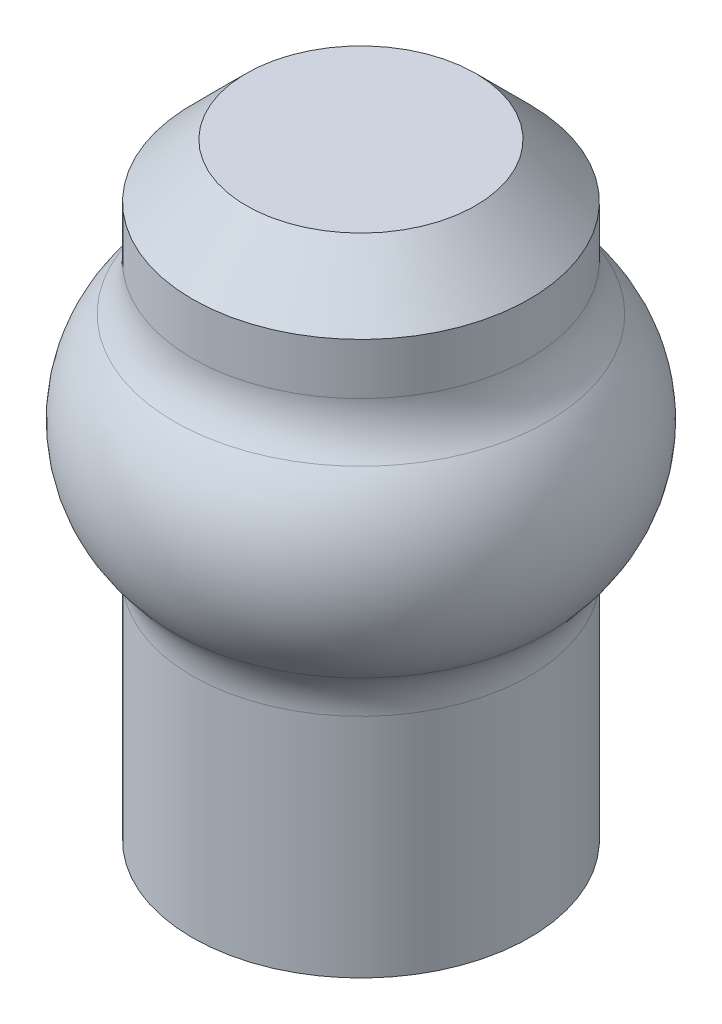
ISO-10303-21;
HEADER;
FILE_DESCRIPTION(('STEP AP214'),'2;1');
FILE_NAME('part.step','',(''),(''),'','','');
FILE_SCHEMA(('AUTOMOTIVE_DESIGN { 1 0 10303 214 1 1 1 1 }'));
ENDSEC;
DATA;
#1=APPLICATION_CONTEXT('core data for automotive mechanical design processes');
#2=APPLICATION_PROTOCOL_DEFINITION('international standard','automotive_design',2000,#1);
#3=PRODUCT_CONTEXT('',#1,'mechanical');
#4=PRODUCT('Part','Part','',(#3));
#5=PRODUCT_RELATED_PRODUCT_CATEGORY('part','',(#4));
#6=PRODUCT_DEFINITION_FORMATION('','',#4);
#7=PRODUCT_DEFINITION_CONTEXT('part definition',#1,'design');
#8=PRODUCT_DEFINITION('design','',#6,#7);
#9=PRODUCT_DEFINITION_SHAPE('','',#8);
#10=(LENGTH_UNIT() NAMED_UNIT(*) SI_UNIT(.MILLI.,.METRE.));
#11=(NAMED_UNIT(*) PLANE_ANGLE_UNIT() SI_UNIT($,.RADIAN.));
#12=(NAMED_UNIT(*) SI_UNIT($,.STERADIAN.) SOLID_ANGLE_UNIT());
#13=UNCERTAINTY_MEASURE_WITH_UNIT(LENGTH_MEASURE(1.E-05),#10,'distance_accuracy_value','');
#14=(GEOMETRIC_REPRESENTATION_CONTEXT(3) GLOBAL_UNCERTAINTY_ASSIGNED_CONTEXT((#13)) GLOBAL_UNIT_ASSIGNED_CONTEXT((#10,
#11,#12)) REPRESENTATION_CONTEXT('',''));
#15=CARTESIAN_POINT('',(0.,0.,0.));
#16=DIRECTION('',(0.,0.,1.));
#17=DIRECTION('',(1.,0.,0.));
#18=AXIS2_PLACEMENT_3D('',#15,#16,#17);
#19=CARTESIAN_POINT('',(0.,0.,0.));
#20=DIRECTION('',(0.,1.,0.));
#21=DIRECTION('',(0.,0.,1.));
#22=AXIS2_PLACEMENT_3D('',#19,#20,#21);
#23=PLANE('',#22);
#24=CARTESIAN_POINT('',(0.,0.,0.));
#25=DIRECTION('',(0.,-1.,0.));
#26=DIRECTION('',(0.,0.,-1.));
#27=AXIS2_PLACEMENT_3D('',#24,#25,#26);
#28=CIRCLE('',#27,12.5);
#29=CARTESIAN_POINT('',(0.,0.,-12.5));
#30=VERTEX_POINT('',#29);
#31=EDGE_CURVE('E40',#30,#30,#28,.T.);
#32=ORIENTED_EDGE('',*,*,#31,.T.);
#33=EDGE_LOOP('',(#32));
#34=FACE_BOUND('',#33,.T.);
#35=ADVANCED_FACE('F30',(#34),#23,.F.);
#36=CARTESIAN_POINT('',(0.,0.,0.));
#37=DIRECTION('',(0.,-1.,0.));
#38=DIRECTION('',(0.,0.,-1.));
#39=AXIS2_PLACEMENT_3D('',#36,#37,#38);
#40=CYLINDRICAL_SURFACE('',#39,12.5);
#41=ORIENTED_EDGE('',*,*,#31,.F.);
#42=EDGE_LOOP('',(#41));
#43=FACE_BOUND('',#42,.T.);
#44=CARTESIAN_POINT('',(0.,16.8019609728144,0.));
#45=DIRECTION('',(0.,-1.,0.));
#46=DIRECTION('',(0.,0.,-1.));
#47=AXIS2_PLACEMENT_3D('',#44,#45,#46);
#48=CIRCLE('',#47,12.5);
#49=CARTESIAN_POINT('',(0.,16.8019609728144,-12.5));
#50=VERTEX_POINT('',#49);
#51=EDGE_CURVE('E44',#50,#50,#48,.T.);
#52=ORIENTED_EDGE('',*,*,#51,.T.);
#53=EDGE_LOOP('',(#52));
#54=FACE_BOUND('',#53,.T.);
#55=ADVANCED_FACE('F76',(#43,#54),#40,.T.);
#56=CARTESIAN_POINT('',(0.,16.8019609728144,0.));
#57=DIRECTION('',(0.,-1.,0.));
#58=DIRECTION('',(0.,0.,-1.));
#59=AXIS2_PLACEMENT_3D('',#56,#57,#58);
#60=TOROIDAL_SURFACE('',#59,17.5,5.);
#61=ORIENTED_EDGE('',*,*,#51,.F.);
#62=EDGE_LOOP('',(#61));
#63=FACE_BOUND('',#62,.T.);
#64=CARTESIAN_POINT('',(0.,20.2013073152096,0.));
#65=DIRECTION('',(0.,-1.,0.));
#66=DIRECTION('',(0.,0.,-1.));
#67=AXIS2_PLACEMENT_3D('',#64,#65,#66);
#68=CIRCLE('',#67,13.8333333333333);
#69=CARTESIAN_POINT('',(0.,20.2013073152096,-13.8333333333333));
#70=VERTEX_POINT('',#69);
#71=EDGE_CURVE('E49',#70,#70,#68,.T.);
#72=ORIENTED_EDGE('',*,*,#71,.T.);
#73=EDGE_LOOP('',(#72));
#74=FACE_BOUND('',#73,.T.);
#75=ADVANCED_FACE('F82',(#63,#74),#60,.F.);
#76=CARTESIAN_POINT('',(0.,27.,0.));
#77=DIRECTION('',(0.,-1.,0.));
#78=DIRECTION('',(0.,0.,-1.));
#79=AXIS2_PLACEMENT_3D('',#76,#77,#78);
#80=DEGENERATE_TOROIDAL_SURFACE('',#79,6.5,10.,.T.);
#81=ORIENTED_EDGE('',*,*,#71,.F.);
#82=EDGE_LOOP('',(#81));
#83=FACE_BOUND('',#82,.T.);
#84=CARTESIAN_POINT('',(0.,33.7986926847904,0.));
#85=DIRECTION('',(0.,-1.,0.));
#86=DIRECTION('',(0.,0.,-1.));
#87=AXIS2_PLACEMENT_3D('',#84,#85,#86);
#88=CIRCLE('',#87,13.8333333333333);
#89=CARTESIAN_POINT('',(0.,33.7986926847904,-13.8333333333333));
#90=VERTEX_POINT('',#89);
#91=EDGE_CURVE('E52',#90,#90,#88,.T.);
#92=ORIENTED_EDGE('',*,*,#91,.T.);
#93=EDGE_LOOP('',(#92));
#94=FACE_BOUND('',#93,.T.);
#95=ADVANCED_FACE('F72',(#83,#94),#80,.T.);
#96=CARTESIAN_POINT('',(0.,37.1980390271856,0.));
#97=DIRECTION('',(0.,-1.,0.));
#98=DIRECTION('',(0.,0.,-1.));
#99=AXIS2_PLACEMENT_3D('',#96,#97,#98);
#100=TOROIDAL_SURFACE('',#99,17.5,5.);
#101=ORIENTED_EDGE('',*,*,#91,.F.);
#102=EDGE_LOOP('',(#101));
#103=FACE_BOUND('',#102,.T.);
#104=CARTESIAN_POINT('',(0.,37.1980390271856,0.));
#105=DIRECTION('',(0.,-1.,0.));
#106=DIRECTION('',(0.,0.,-1.));
#107=AXIS2_PLACEMENT_3D('',#104,#105,#106);
#108=CIRCLE('',#107,12.5);
#109=CARTESIAN_POINT('',(0.,37.1980390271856,-12.5));
#110=VERTEX_POINT('',#109);
#111=EDGE_CURVE('E55',#110,#110,#108,.T.);
#112=ORIENTED_EDGE('',*,*,#111,.T.);
#113=EDGE_LOOP('',(#112));
#114=FACE_BOUND('',#113,.T.);
#115=ADVANCED_FACE('F59',(#103,#114),#100,.F.);
#116=CARTESIAN_POINT('',(0.,0.,0.));
#117=DIRECTION('',(0.,-1.,0.));
#118=DIRECTION('',(0.,0.,-1.));
#119=AXIS2_PLACEMENT_3D('',#116,#117,#118);
#120=CYLINDRICAL_SURFACE('',#119,12.5);
#121=CARTESIAN_POINT('',(0.,41.,0.));
#122=DIRECTION('',(0.,-1.,0.));
#123=DIRECTION('',(0.,0.,-1.));
#124=AXIS2_PLACEMENT_3D('',#121,#122,#123);
#125=CIRCLE('',#124,12.5);
#126=CARTESIAN_POINT('',(0.,41.,-12.5));
#127=VERTEX_POINT('',#126);
#128=EDGE_CURVE('E36',#127,#127,#125,.T.);
#129=ORIENTED_EDGE('',*,*,#128,.T.);
#130=EDGE_LOOP('',(#129));
#131=FACE_BOUND('',#130,.T.);
#132=ORIENTED_EDGE('',*,*,#111,.F.);
#133=EDGE_LOOP('',(#132));
#134=FACE_BOUND('',#133,.T.);
#135=ADVANCED_FACE('F61',(#131,#134),#120,.T.);
#136=CARTESIAN_POINT('',(0.,45.,0.));
#137=DIRECTION('',(0.,-1.,0.));
#138=DIRECTION('',(0.,0.,-1.));
#139=AXIS2_PLACEMENT_3D('',#136,#137,#138);
#140=PLANE('',#139);
#141=CARTESIAN_POINT('',(0.,45.,0.));
#142=DIRECTION('',(0.,-1.,0.));
#143=DIRECTION('',(0.,0.,-1.));
#144=AXIS2_PLACEMENT_3D('',#141,#142,#143);
#145=CIRCLE('',#144,8.49999999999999);
#146=CARTESIAN_POINT('',(0.,45.,-8.49999999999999));
#147=VERTEX_POINT('',#146);
#148=EDGE_CURVE('E10',#147,#147,#145,.F.);
#149=ORIENTED_EDGE('',*,*,#148,.T.);
#150=EDGE_LOOP('',(#149));
#151=FACE_BOUND('',#150,.T.);
#152=ADVANCED_FACE('F63',(#151),#140,.F.);
#153=CARTESIAN_POINT('',(0.,41.,0.));
#154=DIRECTION('',(0.,-1.,0.));
#155=DIRECTION('',(0.,0.,-1.));
#156=AXIS2_PLACEMENT_3D('',#153,#154,#155);
#157=CONICAL_SURFACE('',#156,12.5,0.78539816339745);
#158=ORIENTED_EDGE('',*,*,#148,.F.);
#159=EDGE_LOOP('',(#158));
#160=FACE_BOUND('',#159,.T.);
#161=ORIENTED_EDGE('',*,*,#128,.F.);
#162=EDGE_LOOP('',(#161));
#163=FACE_BOUND('',#162,.T.);
#164=ADVANCED_FACE('F69',(#160,#163),#157,.T.);
#165=CLOSED_SHELL('',(#35,#55,#75,#95,#115,#135,#152,#164));
#166=MANIFOLD_SOLID_BREP('B2',#165);
#167=ADVANCED_BREP_SHAPE_REPRESENTATION('',(#18,#166),#14);
#168=SHAPE_DEFINITION_REPRESENTATION(#9,#167);
ENDSEC;
END-ISO-10303-21;
